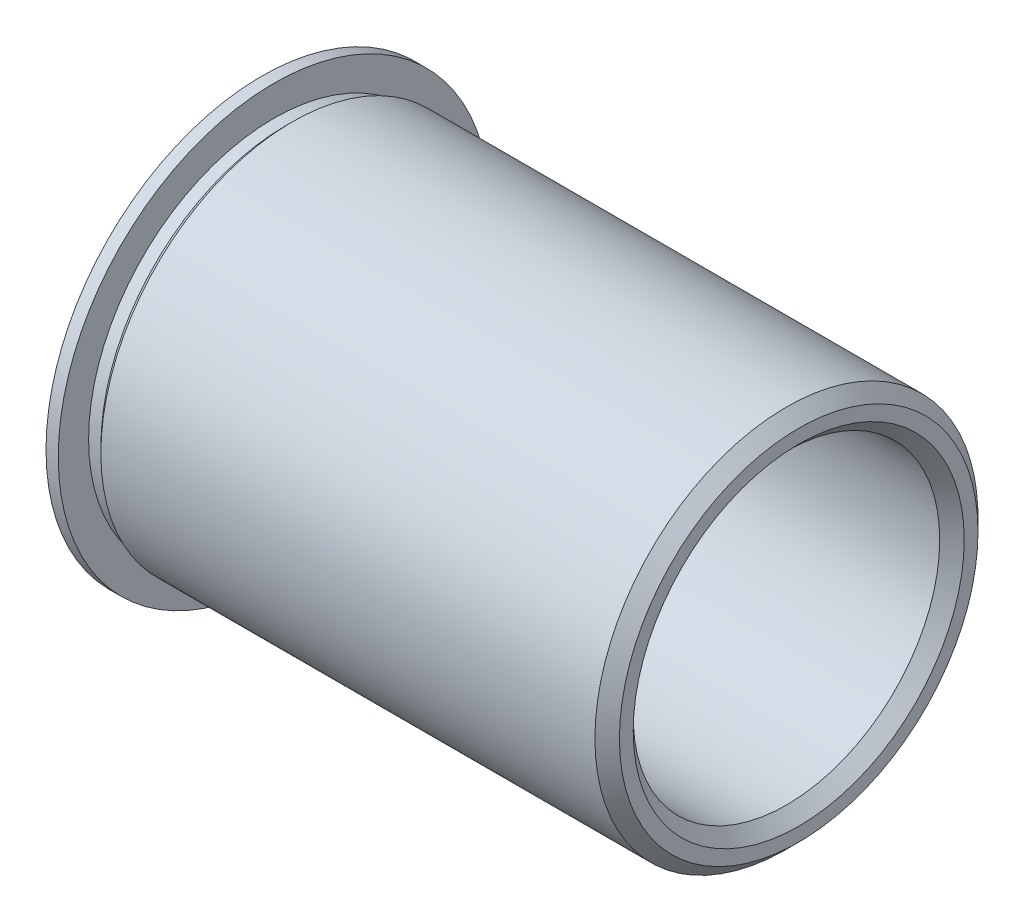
ISO-10303-21;
HEADER;
FILE_DESCRIPTION(('STEP AP214'),'2;1');
FILE_NAME('part.step','',(''),(''),'','','');
FILE_SCHEMA(('AUTOMOTIVE_DESIGN { 1 0 10303 214 1 1 1 1 }'));
ENDSEC;
DATA;
#1=APPLICATION_CONTEXT('core data for automotive mechanical design processes');
#2=APPLICATION_PROTOCOL_DEFINITION('international standard','automotive_design',2000,#1);
#3=PRODUCT_CONTEXT('',#1,'mechanical');
#4=PRODUCT('Part','Part','',(#3));
#5=PRODUCT_RELATED_PRODUCT_CATEGORY('part','',(#4));
#6=PRODUCT_DEFINITION_FORMATION('','',#4);
#7=PRODUCT_DEFINITION_CONTEXT('part definition',#1,'design');
#8=PRODUCT_DEFINITION('design','',#6,#7);
#9=PRODUCT_DEFINITION_SHAPE('','',#8);
#10=(LENGTH_UNIT() NAMED_UNIT(*) SI_UNIT(.MILLI.,.METRE.));
#11=(NAMED_UNIT(*) PLANE_ANGLE_UNIT() SI_UNIT($,.RADIAN.));
#12=(NAMED_UNIT(*) SI_UNIT($,.STERADIAN.) SOLID_ANGLE_UNIT());
#13=UNCERTAINTY_MEASURE_WITH_UNIT(LENGTH_MEASURE(1.E-05),#10,'distance_accuracy_value','');
#14=(GEOMETRIC_REPRESENTATION_CONTEXT(3) GLOBAL_UNCERTAINTY_ASSIGNED_CONTEXT((#13)) GLOBAL_UNIT_ASSIGNED_CONTEXT((#10,
#11,#12)) REPRESENTATION_CONTEXT('',''));
#15=CARTESIAN_POINT('',(0.,0.,0.));
#16=DIRECTION('',(0.,0.,1.));
#17=DIRECTION('',(1.,0.,0.));
#18=AXIS2_PLACEMENT_3D('',#15,#16,#17);
#19=CARTESIAN_POINT('',(-45.0910828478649,94.6526873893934,0.));
#20=DIRECTION('',(-1.,0.,0.));
#21=DIRECTION('',(0.,0.,1.));
#22=AXIS2_PLACEMENT_3D('',#19,#20,#21);
#23=PLANE('',#22);
#24=CARTESIAN_POINT('',(-45.0910828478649,94.6526873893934,0.));
#25=DIRECTION('',(-1.,0.,0.));
#26=DIRECTION('',(0.,0.,1.));
#27=AXIS2_PLACEMENT_3D('',#24,#25,#26);
#28=CIRCLE('',#27,3.42900000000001);
#29=CARTESIAN_POINT('',(-45.0910828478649,94.6526873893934,3.42900000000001));
#30=VERTEX_POINT('',#29);
#31=EDGE_CURVE('E10',#30,#30,#28,.T.);
#32=ORIENTED_EDGE('',*,*,#31,.T.);
#33=EDGE_LOOP('',(#32));
#34=FACE_BOUND('',#33,.T.);
#35=CARTESIAN_POINT('',(-45.0910828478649,94.6526873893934,0.));
#36=DIRECTION('',(-1.,0.,0.));
#37=DIRECTION('',(0.,0.,1.));
#38=AXIS2_PLACEMENT_3D('',#35,#36,#37);
#39=CIRCLE('',#38,3.71475);
#40=CARTESIAN_POINT('',(-45.0910828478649,94.6526873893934,3.71475));
#41=VERTEX_POINT('',#40);
#42=EDGE_CURVE('E53',#41,#41,#39,.T.);
#43=ORIENTED_EDGE('',*,*,#42,.F.);
#44=EDGE_LOOP('',(#43));
#45=FACE_BOUND('',#44,.T.);
#46=ADVANCED_FACE('F33',(#34,#45),#23,.F.);
#47=CARTESIAN_POINT('',(-45.0910828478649,94.6526873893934,0.));
#48=DIRECTION('',(-1.,0.,0.));
#49=DIRECTION('',(0.,0.,1.));
#50=AXIS2_PLACEMENT_3D('',#47,#48,#49);
#51=CONICAL_SURFACE('',#50,3.71475,0.785398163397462);
#52=CARTESIAN_POINT('',(-45.3450828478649,94.6526873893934,0.));
#53=DIRECTION('',(-1.,0.,0.));
#54=DIRECTION('',(0.,0.,1.));
#55=AXIS2_PLACEMENT_3D('',#52,#53,#54);
#56=CIRCLE('',#55,3.96875000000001);
#57=CARTESIAN_POINT('',(-45.3450828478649,94.6526873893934,3.96875000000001));
#58=VERTEX_POINT('',#57);
#59=EDGE_CURVE('E56',#58,#58,#56,.T.);
#60=ORIENTED_EDGE('',*,*,#59,.F.);
#61=EDGE_LOOP('',(#60));
#62=FACE_BOUND('',#61,.T.);
#63=ORIENTED_EDGE('',*,*,#42,.T.);
#64=EDGE_LOOP('',(#63));
#65=FACE_BOUND('',#64,.T.);
#66=ADVANCED_FACE('F104',(#62,#65),#51,.T.);
#67=CARTESIAN_POINT('',(-56.216282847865,94.6526873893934,0.));
#68=DIRECTION('',(-1.,0.,0.));
#69=DIRECTION('',(0.,0.,1.));
#70=AXIS2_PLACEMENT_3D('',#67,#68,#69);
#71=CYLINDRICAL_SURFACE('',#70,3.96875000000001);
#72=CARTESIAN_POINT('',(-55.581282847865,94.6526873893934,0.));
#73=DIRECTION('',(-1.,0.,0.));
#74=DIRECTION('',(0.,0.,1.));
#75=AXIS2_PLACEMENT_3D('',#72,#73,#74);
#76=CIRCLE('',#75,3.96875000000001);
#77=CARTESIAN_POINT('',(-55.581282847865,94.6526873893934,3.96875000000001));
#78=VERTEX_POINT('',#77);
#79=EDGE_CURVE('E59',#78,#78,#76,.T.);
#80=ORIENTED_EDGE('',*,*,#79,.F.);
#81=EDGE_LOOP('',(#80));
#82=FACE_BOUND('',#81,.T.);
#83=ORIENTED_EDGE('',*,*,#59,.T.);
#84=EDGE_LOOP('',(#83));
#85=FACE_BOUND('',#84,.T.);
#86=ADVANCED_FACE('F98',(#82,#85),#71,.T.);
#87=CARTESIAN_POINT('',(-55.581282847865,94.6526873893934,0.));
#88=DIRECTION('',(1.,0.,0.));
#89=DIRECTION('',(0.,0.,-1.));
#90=AXIS2_PLACEMENT_3D('',#87,#88,#89);
#91=CONICAL_SURFACE('',#90,3.96875000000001,0.785398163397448);
#92=CARTESIAN_POINT('',(-55.708282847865,94.6526873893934,0.));
#93=DIRECTION('',(-1.,0.,0.));
#94=DIRECTION('',(0.,0.,1.));
#95=AXIS2_PLACEMENT_3D('',#92,#93,#94);
#96=CIRCLE('',#95,3.84175);
#97=CARTESIAN_POINT('',(-55.708282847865,94.6526873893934,3.84175));
#98=VERTEX_POINT('',#97);
#99=EDGE_CURVE('E62',#98,#98,#96,.T.);
#100=ORIENTED_EDGE('',*,*,#99,.F.);
#101=EDGE_LOOP('',(#100));
#102=FACE_BOUND('',#101,.T.);
#103=ORIENTED_EDGE('',*,*,#79,.T.);
#104=EDGE_LOOP('',(#103));
#105=FACE_BOUND('',#104,.T.);
#106=ADVANCED_FACE('F92',(#102,#105),#91,.T.);
#107=CARTESIAN_POINT('',(-56.216282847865,94.6526873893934,0.));
#108=DIRECTION('',(-1.,0.,0.));
#109=DIRECTION('',(0.,0.,1.));
#110=AXIS2_PLACEMENT_3D('',#107,#108,#109);
#111=CYLINDRICAL_SURFACE('',#110,3.84175);
#112=CARTESIAN_POINT('',(-55.962282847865,94.6526873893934,0.));
#113=DIRECTION('',(-1.,0.,0.));
#114=DIRECTION('',(0.,0.,1.));
#115=AXIS2_PLACEMENT_3D('',#112,#113,#114);
#116=CIRCLE('',#115,3.84175);
#117=CARTESIAN_POINT('',(-55.962282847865,94.6526873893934,3.84175));
#118=VERTEX_POINT('',#117);
#119=EDGE_CURVE('E65',#118,#118,#116,.T.);
#120=ORIENTED_EDGE('',*,*,#119,.F.);
#121=EDGE_LOOP('',(#120));
#122=FACE_BOUND('',#121,.T.);
#123=ORIENTED_EDGE('',*,*,#99,.T.);
#124=EDGE_LOOP('',(#123));
#125=FACE_BOUND('',#124,.T.);
#126=ADVANCED_FACE('F86',(#122,#125),#111,.T.);
#127=CARTESIAN_POINT('',(-55.962282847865,98.4944373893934,0.));
#128=DIRECTION('',(-1.,0.,0.));
#129=DIRECTION('',(0.,0.,1.));
#130=AXIS2_PLACEMENT_3D('',#127,#128,#129);
#131=PLANE('',#130);
#132=CARTESIAN_POINT('',(-55.962282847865,94.6526873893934,0.));
#133=DIRECTION('',(-1.,0.,0.));
#134=DIRECTION('',(0.,0.,1.));
#135=AXIS2_PLACEMENT_3D('',#132,#133,#134);
#136=CIRCLE('',#135,4.47040000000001);
#137=CARTESIAN_POINT('',(-55.962282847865,94.6526873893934,4.47040000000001));
#138=VERTEX_POINT('',#137);
#139=EDGE_CURVE('E68',#138,#138,#136,.T.);
#140=ORIENTED_EDGE('',*,*,#139,.F.);
#141=EDGE_LOOP('',(#140));
#142=FACE_BOUND('',#141,.T.);
#143=ORIENTED_EDGE('',*,*,#119,.T.);
#144=EDGE_LOOP('',(#143));
#145=FACE_BOUND('',#144,.T.);
#146=ADVANCED_FACE('F80',(#142,#145),#131,.F.);
#147=CARTESIAN_POINT('',(-56.216282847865,94.6526873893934,0.));
#148=DIRECTION('',(-1.,0.,0.));
#149=DIRECTION('',(0.,0.,1.));
#150=AXIS2_PLACEMENT_3D('',#147,#148,#149);
#151=CYLINDRICAL_SURFACE('',#150,4.47040000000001);
#152=CARTESIAN_POINT('',(-56.216282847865,94.6526873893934,0.));
#153=DIRECTION('',(-1.,0.,0.));
#154=DIRECTION('',(0.,0.,1.));
#155=AXIS2_PLACEMENT_3D('',#152,#153,#154);
#156=CIRCLE('',#155,4.4704);
#157=CARTESIAN_POINT('',(-56.216282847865,94.6526873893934,4.4704));
#158=VERTEX_POINT('',#157);
#159=EDGE_CURVE('E71',#158,#158,#156,.T.);
#160=ORIENTED_EDGE('',*,*,#159,.F.);
#161=EDGE_LOOP('',(#160));
#162=FACE_BOUND('',#161,.T.);
#163=ORIENTED_EDGE('',*,*,#139,.T.);
#164=EDGE_LOOP('',(#163));
#165=FACE_BOUND('',#164,.T.);
#166=ADVANCED_FACE('F77',(#162,#165),#151,.T.);
#167=CARTESIAN_POINT('',(-56.216282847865,94.6526873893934,0.));
#168=DIRECTION('',(1.,0.,0.));
#169=DIRECTION('',(0.,0.,-1.));
#170=AXIS2_PLACEMENT_3D('',#167,#168,#169);
#171=PLANE('',#170);
#172=CARTESIAN_POINT('',(-56.216282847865,94.6526873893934,0.));
#173=DIRECTION('',(1.,0.,0.));
#174=DIRECTION('',(0.,0.,-1.));
#175=AXIS2_PLACEMENT_3D('',#172,#173,#174);
#176=CIRCLE('',#175,3.42899999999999);
#177=CARTESIAN_POINT('',(-56.216282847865,94.6526873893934,-3.42899999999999));
#178=VERTEX_POINT('',#177);
#179=EDGE_CURVE('E48',#178,#178,#176,.T.);
#180=ORIENTED_EDGE('',*,*,#179,.T.);
#181=EDGE_LOOP('',(#180));
#182=FACE_BOUND('',#181,.T.);
#183=ORIENTED_EDGE('',*,*,#159,.T.);
#184=EDGE_LOOP('',(#183));
#185=FACE_BOUND('',#184,.T.);
#186=ADVANCED_FACE('F75',(#182,#185),#171,.F.);
#187=CARTESIAN_POINT('',(-56.216282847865,94.6526873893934,0.));
#188=DIRECTION('',(1.,0.,0.));
#189=DIRECTION('',(0.,0.,-1.));
#190=AXIS2_PLACEMENT_3D('',#187,#188,#189);
#191=CYLINDRICAL_SURFACE('',#190,3.175);
#192=CARTESIAN_POINT('',(-45.345082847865,94.6526873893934,0.));
#193=DIRECTION('',(-1.,0.,0.));
#194=DIRECTION('',(0.,0.,1.));
#195=AXIS2_PLACEMENT_3D('',#192,#193,#194);
#196=CIRCLE('',#195,3.175);
#197=CARTESIAN_POINT('',(-45.3450828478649,94.6526873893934,-3.175));
#198=VERTEX_POINT('',#197);
#199=EDGE_CURVE('E40',#198,#198,#196,.F.);
#200=CARTESIAN_POINT('',(-55.962282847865,94.6526873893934,0.));
#201=DIRECTION('',(1.,0.,0.));
#202=DIRECTION('',(0.,0.,-1.));
#203=AXIS2_PLACEMENT_3D('',#200,#201,#202);
#204=CIRCLE('',#203,3.175);
#205=CARTESIAN_POINT('',(-55.962282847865,94.6526873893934,-3.175));
#206=VERTEX_POINT('',#205);
#207=EDGE_CURVE('E44',#206,#206,#204,.F.);
#208=CARTESIAN_POINT('',(-45.3450828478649,94.6526873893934,-3.175));
#209=CARTESIAN_POINT('',(-45.4556786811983,94.6526873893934,-3.175));
#210=CARTESIAN_POINT('',(-45.5662745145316,94.6526873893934,-3.175));
#211=CARTESIAN_POINT('',(-45.7874661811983,94.6526873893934,-3.175));
#212=CARTESIAN_POINT('',(-45.8980620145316,94.6526873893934,-3.175));
#213=CARTESIAN_POINT('',(-46.1192536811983,94.6526873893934,-3.175));
#214=CARTESIAN_POINT('',(-46.2298495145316,94.6526873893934,-3.175));
#215=CARTESIAN_POINT('',(-46.4510411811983,94.6526873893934,-3.175));
#216=CARTESIAN_POINT('',(-46.5616370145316,94.6526873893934,-3.175));
#217=CARTESIAN_POINT('',(-46.7828286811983,94.6526873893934,-3.175));
#218=CARTESIAN_POINT('',(-46.8934245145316,94.6526873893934,-3.175));
#219=CARTESIAN_POINT('',(-47.1146161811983,94.6526873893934,-3.175));
#220=CARTESIAN_POINT('',(-47.2252120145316,94.6526873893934,-3.175));
#221=CARTESIAN_POINT('',(-47.4464036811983,94.6526873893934,-3.175));
#222=CARTESIAN_POINT('',(-47.5569995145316,94.6526873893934,-3.175));
#223=CARTESIAN_POINT('',(-47.7781911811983,94.6526873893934,-3.175));
#224=CARTESIAN_POINT('',(-47.8887870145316,94.6526873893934,-3.175));
#225=CARTESIAN_POINT('',(-48.1099786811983,94.6526873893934,-3.175));
#226=CARTESIAN_POINT('',(-48.2205745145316,94.6526873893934,-3.175));
#227=CARTESIAN_POINT('',(-48.4417661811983,94.6526873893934,-3.175));
#228=CARTESIAN_POINT('',(-48.5523620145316,94.6526873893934,-3.175));
#229=CARTESIAN_POINT('',(-48.7735536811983,94.6526873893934,-3.175));
#230=CARTESIAN_POINT('',(-48.8841495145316,94.6526873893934,-3.175));
#231=CARTESIAN_POINT('',(-49.1053411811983,94.6526873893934,-3.175));
#232=CARTESIAN_POINT('',(-49.2159370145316,94.6526873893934,-3.175));
#233=CARTESIAN_POINT('',(-49.4371286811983,94.6526873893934,-3.175));
#234=CARTESIAN_POINT('',(-49.5477245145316,94.6526873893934,-3.175));
#235=CARTESIAN_POINT('',(-49.7689161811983,94.6526873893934,-3.175));
#236=CARTESIAN_POINT('',(-49.8795120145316,94.6526873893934,-3.175));
#237=CARTESIAN_POINT('',(-50.1007036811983,94.6526873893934,-3.175));
#238=CARTESIAN_POINT('',(-50.2112995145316,94.6526873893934,-3.175));
#239=CARTESIAN_POINT('',(-50.4324911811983,94.6526873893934,-3.175));
#240=CARTESIAN_POINT('',(-50.5430870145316,94.6526873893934,-3.175));
#241=CARTESIAN_POINT('',(-50.7642786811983,94.6526873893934,-3.175));
#242=CARTESIAN_POINT('',(-50.8748745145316,94.6526873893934,-3.175));
#243=CARTESIAN_POINT('',(-51.0960661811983,94.6526873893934,-3.175));
#244=CARTESIAN_POINT('',(-51.2066620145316,94.6526873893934,-3.175));
#245=CARTESIAN_POINT('',(-51.4278536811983,94.6526873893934,-3.175));
#246=CARTESIAN_POINT('',(-51.5384495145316,94.6526873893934,-3.175));
#247=CARTESIAN_POINT('',(-51.7596411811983,94.6526873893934,-3.175));
#248=CARTESIAN_POINT('',(-51.8702370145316,94.6526873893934,-3.175));
#249=CARTESIAN_POINT('',(-52.0914286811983,94.6526873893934,-3.175));
#250=CARTESIAN_POINT('',(-52.2020245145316,94.6526873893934,-3.175));
#251=CARTESIAN_POINT('',(-52.4232161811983,94.6526873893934,-3.175));
#252=CARTESIAN_POINT('',(-52.5338120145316,94.6526873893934,-3.175));
#253=CARTESIAN_POINT('',(-52.7550036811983,94.6526873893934,-3.175));
#254=CARTESIAN_POINT('',(-52.8655995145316,94.6526873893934,-3.175));
#255=CARTESIAN_POINT('',(-53.0867911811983,94.6526873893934,-3.175));
#256=CARTESIAN_POINT('',(-53.1973870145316,94.6526873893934,-3.175));
#257=CARTESIAN_POINT('',(-53.4185786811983,94.6526873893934,-3.175));
#258=CARTESIAN_POINT('',(-53.5291745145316,94.6526873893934,-3.175));
#259=CARTESIAN_POINT('',(-53.7503661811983,94.6526873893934,-3.175));
#260=CARTESIAN_POINT('',(-53.8609620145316,94.6526873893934,-3.175));
#261=CARTESIAN_POINT('',(-54.0821536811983,94.6526873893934,-3.175));
#262=CARTESIAN_POINT('',(-54.1927495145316,94.6526873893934,-3.175));
#263=CARTESIAN_POINT('',(-54.4139411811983,94.6526873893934,-3.175));
#264=CARTESIAN_POINT('',(-54.5245370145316,94.6526873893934,-3.175));
#265=CARTESIAN_POINT('',(-54.7457286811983,94.6526873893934,-3.175));
#266=CARTESIAN_POINT('',(-54.8563245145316,94.6526873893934,-3.175));
#267=CARTESIAN_POINT('',(-55.0775161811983,94.6526873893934,-3.175));
#268=CARTESIAN_POINT('',(-55.1881120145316,94.6526873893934,-3.175));
#269=CARTESIAN_POINT('',(-55.4093036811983,94.6526873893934,-3.175));
#270=CARTESIAN_POINT('',(-55.5198995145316,94.6526873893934,-3.175));
#271=CARTESIAN_POINT('',(-55.7410911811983,94.6526873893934,-3.175));
#272=CARTESIAN_POINT('',(-55.8516870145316,94.6526873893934,-3.175));
#273=CARTESIAN_POINT('',(-55.962282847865,94.6526873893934,-3.175));
#274=B_SPLINE_CURVE_WITH_KNOTS('',3,(#208,#209,#210,#211,#212,#213,#214,#215,#216,#217,#218,
#219,#220,#221,#222,#223,#224,#225,#226,#227,#228,#229,#230,#231,#232,#233,#234,#235,#236,#237,
#238,#239,#240,#241,#242,#243,#244,#245,#246,#247,#248,#249,#250,#251,#252,#253,#254,#255,#256,
#257,#258,#259,#260,#261,#262,#263,#264,#265,#266,#267,#268,#269,#270,#271,#272,#273),
.UNSPECIFIED.,.F.,.F.,(4,2,2,2,2,2,2,2,2,2,2,2,2,2,2,2,2,2,2,2,2,2,2,2,2,2,2,2,2,2,2,2,4),(0.,
0.3317875,0.663575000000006,0.995362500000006,1.32715000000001,1.65893750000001,
1.99072500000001,2.32251250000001,2.65430000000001,2.9860875,3.317875,3.6496625,3.98145,
4.3132375,4.64502500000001,4.97681250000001,5.30860000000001,5.64038750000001,5.97217500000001,
6.30396250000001,6.63575000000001,6.96753750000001,7.29932500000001,7.63111250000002,
7.96290000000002,8.29468750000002,8.62647500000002,8.95826250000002,9.29005000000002,
9.62183750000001,9.95362500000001,10.2854125,10.6172),.UNSPECIFIED.);
#275=EDGE_CURVE('BSEAM119',#198,#206,#274,.T.);
#276=ORIENTED_EDGE('',*,*,#199,.T.);
#277=ORIENTED_EDGE('',*,*,#207,.T.);
#278=ORIENTED_EDGE('',*,*,#275,.T.);
#279=ORIENTED_EDGE('',*,*,#275,.F.);
#280=EDGE_LOOP('',(#276,#278,#277,#279));
#281=FACE_BOUND('',#280,.T.);
#282=ADVANCED_FACE('F119',(#281),#191,.F.);
#283=CARTESIAN_POINT('',(-56.216282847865,94.6526873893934,0.));
#284=DIRECTION('',(-1.,0.,0.));
#285=DIRECTION('',(0.,0.,1.));
#286=AXIS2_PLACEMENT_3D('',#283,#284,#285);
#287=CONICAL_SURFACE('',#286,3.42899999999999,0.785398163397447);
#288=ORIENTED_EDGE('',*,*,#207,.F.);
#289=EDGE_LOOP('',(#288));
#290=FACE_BOUND('',#289,.T.);
#291=ORIENTED_EDGE('',*,*,#179,.F.);
#292=EDGE_LOOP('',(#291));
#293=FACE_BOUND('',#292,.T.);
#294=ADVANCED_FACE('F117',(#290,#293),#287,.F.);
#295=CARTESIAN_POINT('',(-45.345082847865,94.6526873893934,0.));
#296=DIRECTION('',(1.,0.,0.));
#297=DIRECTION('',(0.,0.,-1.));
#298=AXIS2_PLACEMENT_3D('',#295,#296,#297);
#299=CONICAL_SURFACE('',#298,3.175,0.785398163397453);
#300=ORIENTED_EDGE('',*,*,#31,.F.);
#301=EDGE_LOOP('',(#300));
#302=FACE_BOUND('',#301,.T.);
#303=ORIENTED_EDGE('',*,*,#199,.F.);
#304=EDGE_LOOP('',(#303));
#305=FACE_BOUND('',#304,.T.);
#306=ADVANCED_FACE('F35',(#302,#305),#299,.F.);
#307=CLOSED_SHELL('',(#46,#66,#86,#106,#126,#146,#166,#186,#282,#294,#306));
#308=MANIFOLD_SOLID_BREP('B2',#307);
#309=ADVANCED_BREP_SHAPE_REPRESENTATION('',(#18,#308),#14);
#310=SHAPE_DEFINITION_REPRESENTATION(#9,#309);
ENDSEC;
END-ISO-10303-21;
